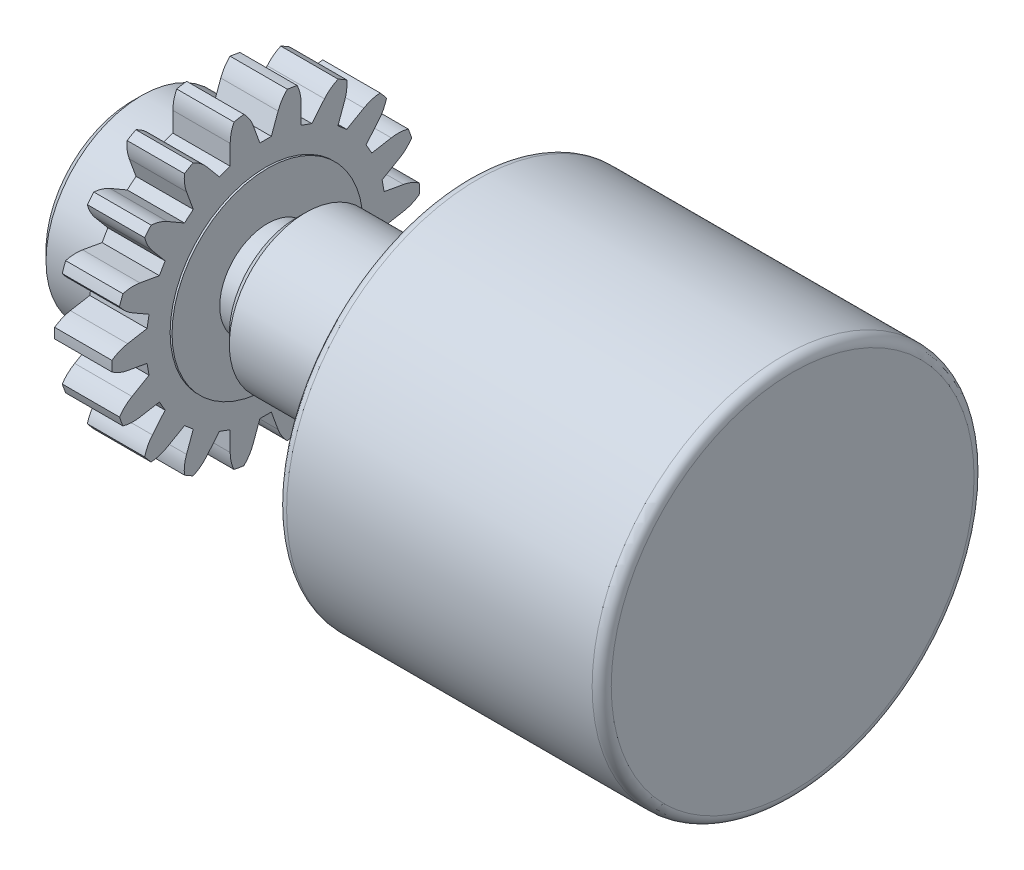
from build123d import *

# Parameters (mm, degrees)
ENL_V_MAT_EXTRU_1_DEPTH      = 13.066689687
R_P_TITION_CIRCULAIRE1_COUNT = 18
ESQUISSE4_R                  = 2.5
BOSS_EXTRU_1_DEPTH           = 1.5
ESQUISSE5_R                  = 4
BOSS_EXTRU_2_DEPTH           = 9
ESQUISSE6_R                  = 10
BOSS_EXTRU_3_DEPTH           = 17
CHANFREIN2_SIZE              = 0.5
CONG_1_R                     = 0.5
CHANFREIN3_SIZE              = 0.5
ESQUISSE7_R                  = 6
ESQUISSE7_R_2                = 4
EXTRU_MINCE1_DEPTH           = 0.5


with BuildPart() as part:
    # Esquisse1 → R_volution1 (revolve)
    with BuildSketch(Plane.XY, mode=Mode.PRIVATE) as r_volution1_sk:
        Polygon((0, 5), (-4, 5), (-4, 0), (3.1, 0), (3.1, 5), (3, 5), (3, 8.05), (0, 8.05), align=None)
    revolve(r_volution1_sk.sketch.rotate(Axis((-19.448313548, 0, 0), (1, 0, 0)), 90), axis=Axis((-19.448313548, 0, 0), (1, 0, 0)))

    # Esquisse2 → Enl_v. mat.-Extru.1 (cut, through all)
    with BuildSketch(Plane.ZY):
        with BuildLine():
            Line((-2.345179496, 8.527515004), (1.385457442, 8.174766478))
            ThreePointArc((1.385457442, 8.174766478), (0.945911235, 7.753987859), (0.653237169, 7.220511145))
            Line((0.653237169, 7.220511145), (0.3, 6.25))
            Line((0.3, 6.25), (-0.300853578, 6.25))
            Line((-0.300853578, 6.25), (-0.65406352, 7.220436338))
            ThreePointArc((-0.65406352, 7.220436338), (-1.310373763, 8.11882695), (-2.345179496, 8.527515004))
        make_face()
    enl_v_mat_extru_1 = extrude(amount=-ENL_V_MAT_EXTRU_1_DEPTH, mode=Mode.SUBTRACT)

    # R_p_tition circulaire1: Enl_v. mat.-Extru.1 ×18 about axis
    r_p_tition_circulaire1_axis = Axis((0, 0, 0), (1, 0, 0))
    for i in range(1, R_P_TITION_CIRCULAIRE1_COUNT):
        add(enl_v_mat_extru_1.rotate(r_p_tition_circulaire1_axis, i * 360 / R_P_TITION_CIRCULAIRE1_COUNT), mode=Mode.SUBTRACT)

    # Esquisse4 → Boss.-Extru.1 (add)
    with BuildSketch(Plane(origin=(3.1, 0, 0), x_dir=(0, 0, -1), z_dir=(1, 0, 0))):
        with Locations(Location((0, 0, 0), (0, 0, 180))):
            Circle(ESQUISSE4_R)
    extrude(amount=BOSS_EXTRU_1_DEPTH)

    # Esquisse5 → Boss.-Extru.2 (add)
    with BuildSketch(Plane(origin=(4.6, 0, 0), x_dir=(0, 0, -1), z_dir=(1, 0, 0))):
        Circle(ESQUISSE5_R)
    extrude(amount=BOSS_EXTRU_2_DEPTH)

    # Esquisse6 → Boss.-Extru.3 (add)
    with BuildSketch(Plane(origin=(13.6, 0, 0), x_dir=(0, 0, -1), z_dir=(1, 0, 0))):
        Circle(ESQUISSE6_R)
    extrude(amount=BOSS_EXTRU_3_DEPTH)

    # Chanfrein2
    chanfrein2_edges = [part.edges().sort_by_distance(p)[0] for p in [
        (4.6, 0, 4),
    ]]
    chamfer(chanfrein2_edges, length=CHANFREIN2_SIZE)

    # Cong_1
    cong_1_edges = [part.edges().sort_by_distance(p)[0] for p in [
        (13.6, 0, 10),
        (30.6, 0, 10),
    ]]
    fillet(cong_1_edges, radius=CONG_1_R)

    # Chanfrein3
    chanfrein3_edges = [part.edges().sort_by_distance(p)[0] for p in [
        (-4, 0, -5),
    ]]
    chamfer(chanfrein3_edges, length=CHANFREIN3_SIZE)


with BuildPart() as body_2:
    # Esquisse7 → Extru.-Mince1 (new body)
    with BuildSketch(Plane.ZY.offset(-13.6)):
        Circle(ESQUISSE7_R)
        Circle(ESQUISSE7_R_2, mode=Mode.SUBTRACT)
    extrude(amount=EXTRU_MINCE1_DEPTH)


solid = Compound([part.part, body_2.part])
